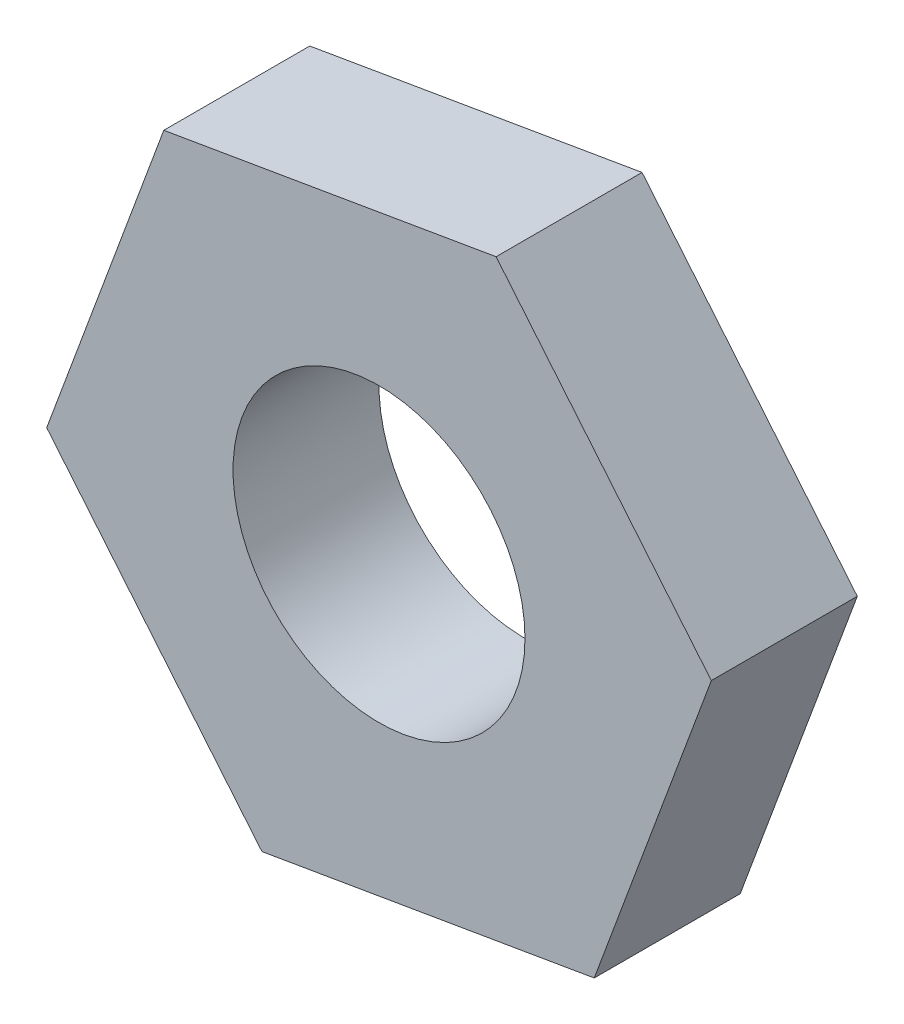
ISO-10303-21;
HEADER;
FILE_DESCRIPTION(('STEP AP214'),'2;1');
FILE_NAME('part.step','',(''),(''),'','','');
FILE_SCHEMA(('AUTOMOTIVE_DESIGN { 1 0 10303 214 1 1 1 1 }'));
ENDSEC;
DATA;
#1=APPLICATION_CONTEXT('core data for automotive mechanical design processes');
#2=APPLICATION_PROTOCOL_DEFINITION('international standard','automotive_design',2000,#1);
#3=PRODUCT_CONTEXT('',#1,'mechanical');
#4=PRODUCT('Part','Part','',(#3));
#5=PRODUCT_RELATED_PRODUCT_CATEGORY('part','',(#4));
#6=PRODUCT_DEFINITION_FORMATION('','',#4);
#7=PRODUCT_DEFINITION_CONTEXT('part definition',#1,'design');
#8=PRODUCT_DEFINITION('design','',#6,#7);
#9=PRODUCT_DEFINITION_SHAPE('','',#8);
#10=(LENGTH_UNIT() NAMED_UNIT(*) SI_UNIT(.MILLI.,.METRE.));
#11=(NAMED_UNIT(*) PLANE_ANGLE_UNIT() SI_UNIT($,.RADIAN.));
#12=(NAMED_UNIT(*) SI_UNIT($,.STERADIAN.) SOLID_ANGLE_UNIT());
#13=UNCERTAINTY_MEASURE_WITH_UNIT(LENGTH_MEASURE(1.E-05),#10,'distance_accuracy_value','');
#14=(GEOMETRIC_REPRESENTATION_CONTEXT(3) GLOBAL_UNCERTAINTY_ASSIGNED_CONTEXT((#13)) GLOBAL_UNIT_ASSIGNED_CONTEXT((#10,
#11,#12)) REPRESENTATION_CONTEXT('',''));
#15=CARTESIAN_POINT('',(0.,0.,0.));
#16=DIRECTION('',(0.,0.,1.));
#17=DIRECTION('',(1.,0.,0.));
#18=AXIS2_PLACEMENT_3D('',#15,#16,#17);
#19=CARTESIAN_POINT('',(-2.2116625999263,2.66618614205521,1.5));
#20=DIRECTION('',(0.,0.,1.));
#21=DIRECTION('',(1.,0.,0.));
#22=AXIS2_PLACEMENT_3D('',#19,#20,#21);
#23=PLANE('',#22);
#24=DIRECTION('',(-0.985772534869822,-0.168084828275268,0.));
#25=VECTOR('',#24,1.);
#26=CARTESIAN_POINT('',(1.20315363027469,3.24844906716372,1.5));
#27=LINE('',#26,#25);
#28=CARTESIAN_POINT('',(1.20315363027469,3.24844906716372,1.5));
#29=VERTEX_POINT('',#28);
#30=CARTESIAN_POINT('',(-2.2116625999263,2.66618614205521,1.5));
#31=VERTEX_POINT('',#30);
#32=EDGE_CURVE('E129',#29,#31,#27,.T.);
#33=ORIENTED_EDGE('',*,*,#32,.T.);
#34=DIRECTION('',(-0.347320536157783,-0.937746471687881,0.));
#35=VECTOR('',#34,1.);
#36=CARTESIAN_POINT('',(-2.2116625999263,2.66618614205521,1.5));
#37=LINE('',#36,#35);
#38=CARTESIAN_POINT('',(-3.41481623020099,-0.58226292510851,1.5));
#39=VERTEX_POINT('',#38);
#40=EDGE_CURVE('E87',#31,#39,#37,.T.);
#41=ORIENTED_EDGE('',*,*,#40,.T.);
#42=DIRECTION('',(0.638451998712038,-0.769661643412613,0.));
#43=VECTOR('',#42,1.);
#44=CARTESIAN_POINT('',(-3.41481623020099,-0.58226292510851,1.5));
#45=LINE('',#44,#43);
#46=CARTESIAN_POINT('',(-1.20315363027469,-3.24844906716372,1.5));
#47=VERTEX_POINT('',#46);
#48=EDGE_CURVE('E100',#39,#47,#45,.T.);
#49=ORIENTED_EDGE('',*,*,#48,.T.);
#50=DIRECTION('',(0.985772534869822,0.168084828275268,0.));
#51=VECTOR('',#50,1.);
#52=CARTESIAN_POINT('',(-1.20315363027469,-3.24844906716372,1.5));
#53=LINE('',#52,#51);
#54=CARTESIAN_POINT('',(2.2116625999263,-2.66618614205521,1.5));
#55=VERTEX_POINT('',#54);
#56=EDGE_CURVE('E94',#47,#55,#53,.T.);
#57=ORIENTED_EDGE('',*,*,#56,.T.);
#58=DIRECTION('',(0.347320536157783,0.937746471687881,0.));
#59=VECTOR('',#58,1.);
#60=CARTESIAN_POINT('',(2.2116625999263,-2.66618614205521,1.5));
#61=LINE('',#60,#59);
#62=CARTESIAN_POINT('',(3.41481623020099,0.58226292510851,1.5));
#63=VERTEX_POINT('',#62);
#64=EDGE_CURVE('E98',#55,#63,#61,.T.);
#65=ORIENTED_EDGE('',*,*,#64,.T.);
#66=DIRECTION('',(-0.638451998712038,0.769661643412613,0.));
#67=VECTOR('',#66,1.);
#68=CARTESIAN_POINT('',(3.41481623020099,0.58226292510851,1.5));
#69=LINE('',#68,#67);
#70=EDGE_CURVE('E50',#63,#29,#69,.T.);
#71=ORIENTED_EDGE('',*,*,#70,.T.);
#72=EDGE_LOOP('',(#33,#41,#49,#57,#65,#71));
#73=FACE_BOUND('',#72,.T.);
#74=CARTESIAN_POINT('',(0.,0.,1.5));
#75=DIRECTION('',(0.,0.,1.));
#76=DIRECTION('',(1.,0.,0.));
#77=AXIS2_PLACEMENT_3D('',#74,#75,#76);
#78=CIRCLE('',#77,1.5);
#79=CARTESIAN_POINT('',(1.5,0.,1.5));
#80=VERTEX_POINT('',#79);
#81=EDGE_CURVE('E122',#80,#80,#78,.T.);
#82=ORIENTED_EDGE('',*,*,#81,.F.);
#83=EDGE_LOOP('',(#82));
#84=FACE_BOUND('',#83,.T.);
#85=ADVANCED_FACE('F33',(#73,#84),#23,.T.);
#86=CARTESIAN_POINT('',(-2.2116625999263,2.66618614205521,0.));
#87=DIRECTION('',(0.,0.,1.));
#88=DIRECTION('',(1.,0.,0.));
#89=AXIS2_PLACEMENT_3D('',#86,#87,#88);
#90=PLANE('',#89);
#91=DIRECTION('',(-0.985772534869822,-0.168084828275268,0.));
#92=VECTOR('',#91,1.);
#93=CARTESIAN_POINT('',(1.20315363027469,3.24844906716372,0.));
#94=LINE('',#93,#92);
#95=CARTESIAN_POINT('',(1.20315363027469,3.24844906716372,0.));
#96=VERTEX_POINT('',#95);
#97=CARTESIAN_POINT('',(-2.2116625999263,2.66618614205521,0.));
#98=VERTEX_POINT('',#97);
#99=EDGE_CURVE('E118',#96,#98,#94,.T.);
#100=ORIENTED_EDGE('',*,*,#99,.F.);
#101=DIRECTION('',(-0.638451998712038,0.769661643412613,0.));
#102=VECTOR('',#101,1.);
#103=CARTESIAN_POINT('',(3.41481623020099,0.58226292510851,0.));
#104=LINE('',#103,#102);
#105=CARTESIAN_POINT('',(3.41481623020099,0.58226292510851,0.));
#106=VERTEX_POINT('',#105);
#107=EDGE_CURVE('E79',#106,#96,#104,.T.);
#108=ORIENTED_EDGE('',*,*,#107,.F.);
#109=DIRECTION('',(0.347320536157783,0.937746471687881,0.));
#110=VECTOR('',#109,1.);
#111=CARTESIAN_POINT('',(2.2116625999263,-2.66618614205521,0.));
#112=LINE('',#111,#110);
#113=CARTESIAN_POINT('',(2.2116625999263,-2.66618614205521,0.));
#114=VERTEX_POINT('',#113);
#115=EDGE_CURVE('E73',#114,#106,#112,.T.);
#116=ORIENTED_EDGE('',*,*,#115,.F.);
#117=DIRECTION('',(0.985772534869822,0.168084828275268,0.));
#118=VECTOR('',#117,1.);
#119=CARTESIAN_POINT('',(-1.20315363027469,-3.24844906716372,0.));
#120=LINE('',#119,#118);
#121=CARTESIAN_POINT('',(-1.20315363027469,-3.24844906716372,0.));
#122=VERTEX_POINT('',#121);
#123=EDGE_CURVE('E108',#122,#114,#120,.T.);
#124=ORIENTED_EDGE('',*,*,#123,.F.);
#125=DIRECTION('',(0.638451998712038,-0.769661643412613,0.));
#126=VECTOR('',#125,1.);
#127=CARTESIAN_POINT('',(-3.41481623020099,-0.58226292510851,0.));
#128=LINE('',#127,#126);
#129=CARTESIAN_POINT('',(-3.41481623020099,-0.58226292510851,0.));
#130=VERTEX_POINT('',#129);
#131=EDGE_CURVE('E124',#130,#122,#128,.T.);
#132=ORIENTED_EDGE('',*,*,#131,.F.);
#133=DIRECTION('',(-0.347320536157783,-0.937746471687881,0.));
#134=VECTOR('',#133,1.);
#135=CARTESIAN_POINT('',(-2.2116625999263,2.66618614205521,0.));
#136=LINE('',#135,#134);
#137=EDGE_CURVE('E121',#98,#130,#136,.T.);
#138=ORIENTED_EDGE('',*,*,#137,.F.);
#139=EDGE_LOOP('',(#100,#108,#116,#124,#132,#138));
#140=FACE_BOUND('',#139,.T.);
#141=CARTESIAN_POINT('',(0.,0.,0.));
#142=DIRECTION('',(0.,0.,1.));
#143=DIRECTION('',(1.,0.,0.));
#144=AXIS2_PLACEMENT_3D('',#141,#142,#143);
#145=CIRCLE('',#144,1.5);
#146=CARTESIAN_POINT('',(1.5,0.,0.));
#147=VERTEX_POINT('',#146);
#148=EDGE_CURVE('E222',#147,#147,#145,.T.);
#149=ORIENTED_EDGE('',*,*,#148,.T.);
#150=EDGE_LOOP('',(#149));
#151=FACE_BOUND('',#150,.T.);
#152=ADVANCED_FACE('F138',(#140,#151),#90,.F.);
#153=CARTESIAN_POINT('',(1.20315363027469,3.24844906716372,1.5));
#154=DIRECTION('',(0.168084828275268,-0.985772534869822,0.));
#155=DIRECTION('',(0.985772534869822,0.168084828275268,0.));
#156=AXIS2_PLACEMENT_3D('',#153,#154,#155);
#157=PLANE('',#156);
#158=ORIENTED_EDGE('',*,*,#99,.T.);
#159=DIRECTION('',(0.,0.,-1.));
#160=VECTOR('',#159,1.);
#161=CARTESIAN_POINT('',(-2.2116625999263,2.66618614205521,1.5));
#162=LINE('',#161,#160);
#163=EDGE_CURVE('E11',#31,#98,#162,.T.);
#164=ORIENTED_EDGE('',*,*,#163,.F.);
#165=ORIENTED_EDGE('',*,*,#32,.F.);
#166=DIRECTION('',(0.,0.,-1.));
#167=VECTOR('',#166,1.);
#168=CARTESIAN_POINT('',(1.20315363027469,3.24844906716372,1.5));
#169=LINE('',#168,#167);
#170=EDGE_CURVE('E114',#29,#96,#169,.T.);
#171=ORIENTED_EDGE('',*,*,#170,.T.);
#172=EDGE_LOOP('',(#158,#164,#165,#171));
#173=FACE_BOUND('',#172,.T.);
#174=ADVANCED_FACE('F35',(#173),#157,.F.);
#175=CARTESIAN_POINT('',(-2.2116625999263,2.66618614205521,1.5));
#176=DIRECTION('',(0.937746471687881,-0.347320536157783,0.));
#177=DIRECTION('',(0.347320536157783,0.937746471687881,0.));
#178=AXIS2_PLACEMENT_3D('',#175,#176,#177);
#179=PLANE('',#178);
#180=ORIENTED_EDGE('',*,*,#137,.T.);
#181=DIRECTION('',(0.,0.,-1.));
#182=VECTOR('',#181,1.);
#183=CARTESIAN_POINT('',(-3.41481623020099,-0.58226292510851,1.5));
#184=LINE('',#183,#182);
#185=EDGE_CURVE('E42',#39,#130,#184,.T.);
#186=ORIENTED_EDGE('',*,*,#185,.F.);
#187=ORIENTED_EDGE('',*,*,#40,.F.);
#188=ORIENTED_EDGE('',*,*,#163,.T.);
#189=EDGE_LOOP('',(#180,#186,#187,#188));
#190=FACE_BOUND('',#189,.T.);
#191=ADVANCED_FACE('F163',(#190),#179,.F.);
#192=CARTESIAN_POINT('',(-3.41481623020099,-0.58226292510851,1.5));
#193=DIRECTION('',(0.769661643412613,0.638451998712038,0.));
#194=DIRECTION('',(-0.638451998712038,0.769661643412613,0.));
#195=AXIS2_PLACEMENT_3D('',#192,#193,#194);
#196=PLANE('',#195);
#197=ORIENTED_EDGE('',*,*,#131,.T.);
#198=DIRECTION('',(0.,0.,-1.));
#199=VECTOR('',#198,1.);
#200=CARTESIAN_POINT('',(-1.20315363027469,-3.24844906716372,1.5));
#201=LINE('',#200,#199);
#202=EDGE_CURVE('E109',#47,#122,#201,.T.);
#203=ORIENTED_EDGE('',*,*,#202,.F.);
#204=ORIENTED_EDGE('',*,*,#48,.F.);
#205=ORIENTED_EDGE('',*,*,#185,.T.);
#206=EDGE_LOOP('',(#197,#203,#204,#205));
#207=FACE_BOUND('',#206,.T.);
#208=ADVANCED_FACE('F135',(#207),#196,.F.);
#209=CARTESIAN_POINT('',(-1.20315363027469,-3.24844906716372,1.5));
#210=DIRECTION('',(-0.168084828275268,0.985772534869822,0.));
#211=DIRECTION('',(-0.985772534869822,-0.168084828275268,0.));
#212=AXIS2_PLACEMENT_3D('',#209,#210,#211);
#213=PLANE('',#212);
#214=ORIENTED_EDGE('',*,*,#123,.T.);
#215=DIRECTION('',(0.,0.,-1.));
#216=VECTOR('',#215,1.);
#217=CARTESIAN_POINT('',(2.2116625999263,-2.66618614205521,1.5));
#218=LINE('',#217,#216);
#219=EDGE_CURVE('E105',#55,#114,#218,.T.);
#220=ORIENTED_EDGE('',*,*,#219,.F.);
#221=ORIENTED_EDGE('',*,*,#56,.F.);
#222=ORIENTED_EDGE('',*,*,#202,.T.);
#223=EDGE_LOOP('',(#214,#220,#221,#222));
#224=FACE_BOUND('',#223,.T.);
#225=ADVANCED_FACE('F106',(#224),#213,.F.);
#226=CARTESIAN_POINT('',(2.2116625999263,-2.66618614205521,1.5));
#227=DIRECTION('',(-0.937746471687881,0.347320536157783,0.));
#228=DIRECTION('',(-0.347320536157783,-0.937746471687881,0.));
#229=AXIS2_PLACEMENT_3D('',#226,#227,#228);
#230=PLANE('',#229);
#231=ORIENTED_EDGE('',*,*,#115,.T.);
#232=DIRECTION('',(0.,0.,-1.));
#233=VECTOR('',#232,1.);
#234=CARTESIAN_POINT('',(3.41481623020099,0.58226292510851,1.5));
#235=LINE('',#234,#233);
#236=EDGE_CURVE('E110',#63,#106,#235,.T.);
#237=ORIENTED_EDGE('',*,*,#236,.F.);
#238=ORIENTED_EDGE('',*,*,#64,.F.);
#239=ORIENTED_EDGE('',*,*,#219,.T.);
#240=EDGE_LOOP('',(#231,#237,#238,#239));
#241=FACE_BOUND('',#240,.T.);
#242=ADVANCED_FACE('F112',(#241),#230,.F.);
#243=CARTESIAN_POINT('',(3.41481623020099,0.58226292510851,1.5));
#244=DIRECTION('',(-0.769661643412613,-0.638451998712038,0.));
#245=DIRECTION('',(0.638451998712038,-0.769661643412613,0.));
#246=AXIS2_PLACEMENT_3D('',#243,#244,#245);
#247=PLANE('',#246);
#248=ORIENTED_EDGE('',*,*,#107,.T.);
#249=ORIENTED_EDGE('',*,*,#170,.F.);
#250=ORIENTED_EDGE('',*,*,#70,.F.);
#251=ORIENTED_EDGE('',*,*,#236,.T.);
#252=EDGE_LOOP('',(#248,#249,#250,#251));
#253=FACE_BOUND('',#252,.T.);
#254=ADVANCED_FACE('F143',(#253),#247,.F.);
#255=CARTESIAN_POINT('',(0.,0.,1.5));
#256=DIRECTION('',(0.,0.,-1.));
#257=DIRECTION('',(-1.,0.,0.));
#258=AXIS2_PLACEMENT_3D('',#255,#256,#257);
#259=CYLINDRICAL_SURFACE('',#258,1.5);
#260=ORIENTED_EDGE('',*,*,#81,.T.);
#261=EDGE_LOOP('',(#260));
#262=FACE_BOUND('',#261,.T.);
#263=ORIENTED_EDGE('',*,*,#148,.F.);
#264=EDGE_LOOP('',(#263));
#265=FACE_BOUND('',#264,.T.);
#266=ADVANCED_FACE('F145',(#262,#265),#259,.F.);
#267=CLOSED_SHELL('',(#85,#152,#174,#191,#208,#225,#242,#254,#266));
#268=MANIFOLD_SOLID_BREP('B2',#267);
#269=ADVANCED_BREP_SHAPE_REPRESENTATION('',(#18,#268),#14);
#270=SHAPE_DEFINITION_REPRESENTATION(#9,#269);
ENDSEC;
END-ISO-10303-21;
